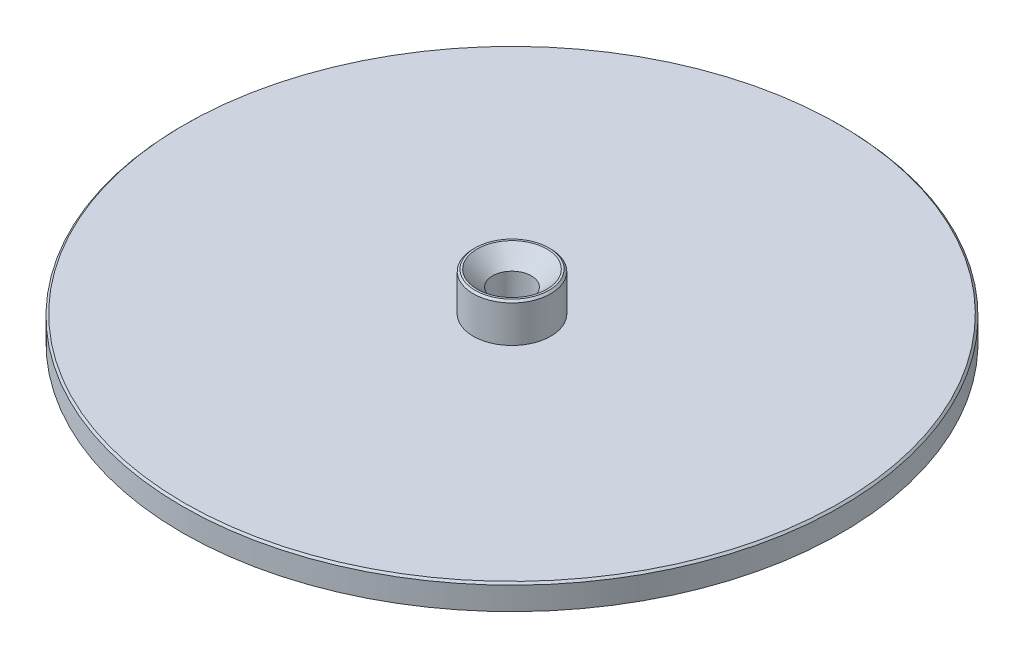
from build123d import *

# Parameters (mm, degrees)
SKETCH1_R             = 85
DISC_DEPTH            = 8
BOTTOM_CHAMFER1_SIZE  = 2.54
BOTTOM_CHAMFER1_SIZE2 = 1.587168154
SKETCH3_R             = 10
TOP_BOSS_DEPTH        = 10
CHAMFER1_SIZE         = 0.5
SKETCH4_R             = 5
THRU_HOLE_DEPTH       = 122.548344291
CHAMFER2_SIZE         = 4


with BuildPart() as part:
    # Sketch1 → DISC (new body)
    with BuildSketch(Plane(origin=(0, 0, 0), x_dir=(1, 0, 0), z_dir=(0, 1, 0))):
        with Locations(Location((0, 0, 0), (0, 0, 270))):
            Circle(SKETCH1_R)
    extrude(amount=DISC_DEPTH)

    # BOTTOM Chamfer1
    bottom_chamfer1_edges = [part.edges().sort_by_distance(p)[0] for p in [
        (0, 0, -85),
    ]]
    bottom_chamfer1_side = [part.faces().sort_by_distance(p)[0] for p in [
        (0, 0, 0),
    ]]
    chamfer(bottom_chamfer1_edges, length=BOTTOM_CHAMFER1_SIZE, length2=BOTTOM_CHAMFER1_SIZE2, reference=bottom_chamfer1_side[0])

    # Sketch3 → TOP BOSS (add)
    with BuildSketch(Plane(origin=(0, 8, 0), x_dir=(1, 0, 0), z_dir=(0, 1, 0))):
        with Locations(Location((0, 0, 0), (0, 0, 270))):
            Circle(SKETCH3_R)
    extrude(amount=TOP_BOSS_DEPTH)

    # Chamfer1
    chamfer1_edges = [part.edges().sort_by_distance(p)[0] for p in [
        (0, 8, -85),
        (0, 18, -10),
    ]]
    chamfer(chamfer1_edges, length=CHAMFER1_SIZE)

    # Sketch4 → thru hole (cut, through all)
    with BuildSketch(Plane(origin=(0, 18, 0), x_dir=(1, 0, 0), z_dir=(0, 1, 0))):
        with Locations(Location((0, 0, 0), (0, 0, 270))):
            Circle(SKETCH4_R)
    extrude(amount=-THRU_HOLE_DEPTH, mode=Mode.SUBTRACT)

    # Chamfer2
    chamfer2_edges = [part.edges().sort_by_distance(p)[0] for p in [
        (0, 0, -5),
        (0, 18, -5),
    ]]
    chamfer(chamfer2_edges, length=CHAMFER2_SIZE)


solid = part.part
